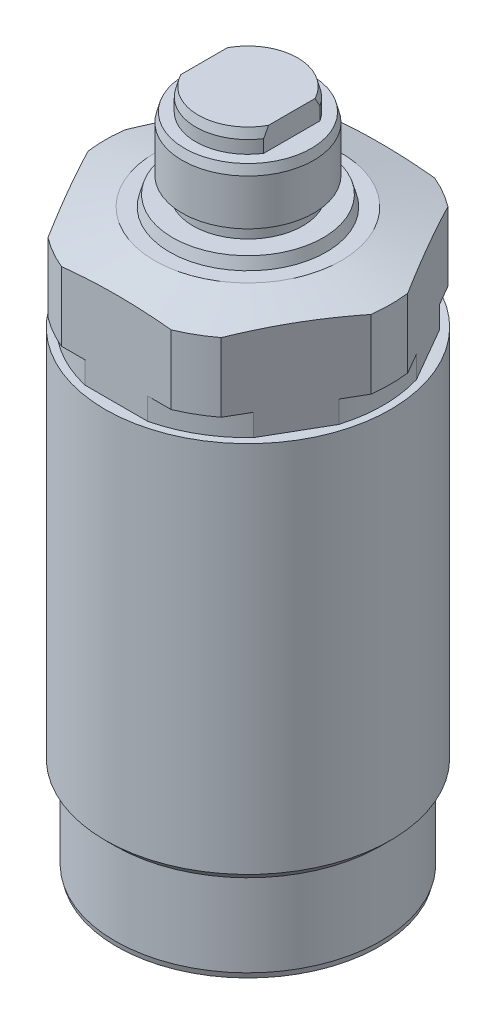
from build123d import *

# Parameters (mm, degrees)
SKETCH2_OUTSIDE_W = 42.4
SKETCH2_OUTSIDE_H = 42.4
EXTRUDE2_DEPTH    = 9.49666638
EXTRUDE3_REACH    = 13072.05


with BuildPart() as part:
    # Sketch1 → Revolve1 (revolve)
    with BuildSketch(Plane.XY, mode=Mode.PRIVATE) as revolve1_sk:
        Polygon((13051.697008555, 11009.261625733), (13051.697008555, 11010.361625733), (13055.896896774, 11010.361625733), (13055.896896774, 11011.258293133), (13056.896896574, 11011.258293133), (13056.896896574, 11071.161625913), (13052.370187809, 11071.161625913), (13052.146896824, 11070.328292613), (13052.146896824, 11069.164958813), (13051.120187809, 11069.164958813), (13050.896896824, 11068.331625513), (13050.896896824, 11064.164958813), (13051.896896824, 11064.164958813), (13051.896896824, 11062.654959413), (13050.036854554, 11062.654959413), (13049.755296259, 11061.661625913), (13048.396896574, 11061.661625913), (13043.896897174, 11060.455854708), (13043.896897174, 11054.164959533), (13044.563563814, 11054.164959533), (13044.563563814, 11052.164959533), (13043.896897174, 11052.164959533), (13043.896897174, 11018.164959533), (13044.796896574, 11017.264960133), (13044.796896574, 11009.761625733), (13044.93087117, 11009.261625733), align=None)
    revolve(revolve1_sk.sketch.rotate(Axis((13056.896896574, 11084.648396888, 0), (0, -1, 0)), 270), axis=Axis((13056.896896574, 11084.648396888, 0), (0, -1, 0)))

    # Sketch2 outside → Extrude2 (cut)
    with BuildSketch(Plane(origin=(0, 11061.661625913, 0), x_dir=(1, 0, 0), z_dir=(0, 1, 0))):
        with Locations((13056.897, 0)):
            Rectangle(SKETCH2_OUTSIDE_W, SKETCH2_OUTSIDE_H)
        Polygon((13070.753303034, 0), (13063.825099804, 12), (13049.968693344, 12), (13043.040490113, 0), (13049.968693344, -12), (13063.825099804, -12), align=None, mode=Mode.SUBTRACT)
    extrude(amount=-EXTRUDE2_DEPTH, mode=Mode.SUBTRACT)

    # Extrude3: up to this face of the body (flat: up to its plane)
    extrude3_end = Plane(part.part.faces().sort_by_distance((13056.896896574, 11069.164958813, -4.913389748))[0])
    # Sketch3 → Extrude3 (cut, up to the picked face)
    with BuildSketch(Plane(origin=(0, 11071.161625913, 0), x_dir=(1, 0, 0), z_dir=(0, 1, 0)), mode=Mode.PRIVATE) as extrude3_sk1:
        Polygon((13060.896896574, 7.851940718), (13060.896896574, -8.74646561), (13068.423694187, -0.925202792), align=None)
    extrude3_tool1 = split(extrude(extrude3_sk1.sketch, amount=-EXTRUDE3_REACH, mode=Mode.PRIVATE), bisect_by=extrude3_end, keep=Keep.BOTH, mode=Mode.PRIVATE)
    # Sketch3 → Extrude3 (cut, up to the picked face)
    with BuildSketch(Plane(origin=(0, 11071.161625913, 0), x_dir=(1, 0, 0), z_dir=(0, 1, 0)), mode=Mode.PRIVATE) as extrude3_sk2:
        Polygon((13052.896896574, -8.74646561), (13052.896896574, 7.5), (13044.501735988, 0.300770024), align=None)
    extrude3_tool2 = split(extrude(extrude3_sk2.sketch, amount=-EXTRUDE3_REACH, mode=Mode.PRIVATE), bisect_by=extrude3_end, keep=Keep.BOTH, mode=Mode.PRIVATE)
    add(extrude3_tool1.solids().sort_by(Axis((13063.405829, 11071.161626, 0.606576), (0, -1, 0)))[0], mode=Mode.SUBTRACT)
    add(extrude3_tool2.solids().sort_by(Axis((13050.09851, 11071.161626, 0.315232), (0, -1, 0)))[0], mode=Mode.SUBTRACT)


solid = part.part
